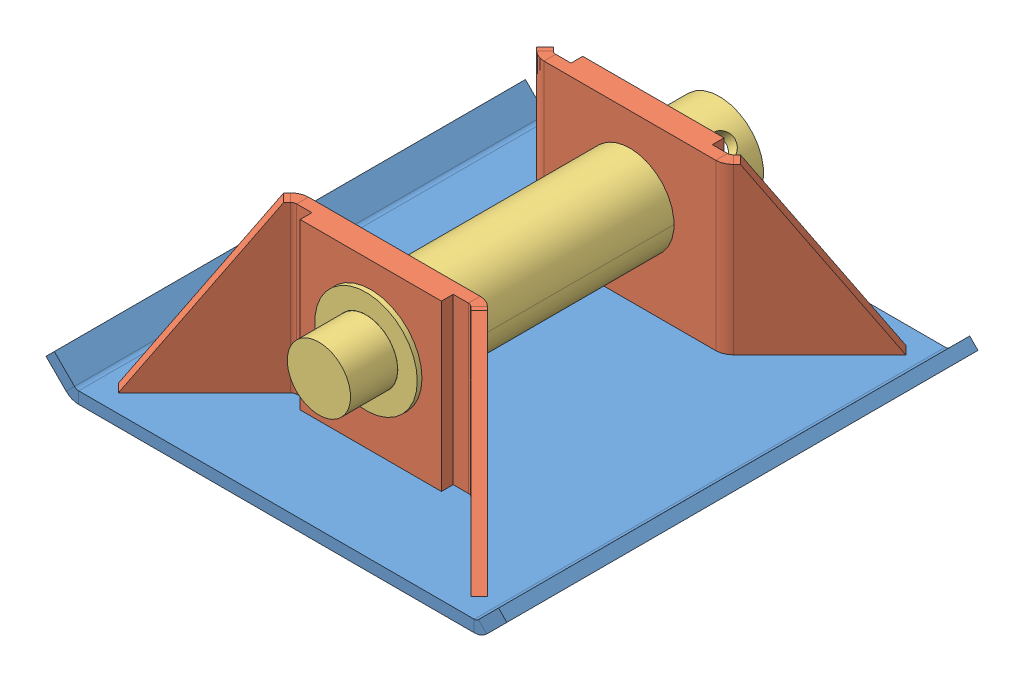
SolidWorks assembly Sandshoe_assembly.SLDASM, configuration Default (file format 8000). Lengths in mm.
Overall size (248.49 95.25 254).
4 component instances, 3 part files, 8 mates.
Components (placement in the parent):
- Sandshoe_Base-1: Sandshoe_Base.SLDPRT [Default] at origin size (248.49 18.15 254)
- Sandshoe_Side-1: Sandshoe_Side.SLDPRT [Default] at (0.0451 0 69.85) size (199.04 88.9 53.76)
- Sandshoe_Side-2: Sandshoe_Side.SLDPRT [Default] at (0.0451 0 -69.85) x (-1 0 0) z (0 0 -1) size (199.04 88.9 53.76)
- Sanshoe_Axle-1: Sanshoe_Axle.SLDPRT [Default] at (0.0451 47.625 -111.76) size (55.25 55.25 215.9)
Mates (geometry in assembly coordinates):
- Coincident1: coincident anti-aligned: plane of Sandshoe_Base-1 through (0 0 0) normal (0 1 0); plane of Sandshoe_Side-1 through (-53.9299 0 63.5) normal (0 -1 0)
- Distance1: distance = 127 mm anti-aligned: plane of Sandshoe_Side-2 through (0.0451 0 -63.5) normal (0 0 1); plane of Sandshoe_Side-1 through (0.0451 0 63.5) normal (0 0 -1)
- Coincident3: coincident anti-aligned: plane of Sandshoe_Base-1 through (0 0 0) normal (0 1 0); plane of Sandshoe_Side-2 through (54.0201 0 -63.5) normal (0 -1 0)
- Concentric1: concentric anti-aligned: cylinder of Sandshoe_Side-1 through (0.0451 47.625 63.5) axis (0 0 1) radius 23.8125; cylinder of Sandshoe_Side-2 through (0.0451 47.625 -63.5) axis (0 0 -1) radius 23.8125
- Distance2: distance = 63.5 mm: line of Sandshoe_Side-1 through (-46.2647 0 63.5) axis (1 0 0); line of Sandshoe_Base-1 through (-106.6349 0 127) axis (1 0 0)
- Distance5: distance = 68.58 mm: line of Sandshoe_Side-2 through (-38.0549 0 -76.2) axis (0 0 1); line of Sandshoe_Base-1 through (-106.6349 0 127) axis (0 0 -1)
- Concentric2: concentric aligned: cylinder of Sandshoe_Side-2 through (0.0451 47.625 -63.5) axis (0 0 -1) radius 23.8125; cylinder of Sanshoe_Axle-1 through (0.0451 47.625 78.74) axis (0 0 -1) radius 17.145
- Coincident11: coincident anti-aligned: plane of Sandshoe_Side-1 through (0.0451 0 76.2) normal (0 0 1); plane of Sanshoe_Axle-1 through (0.0451 47.625 76.2) normal (0 0 -1)
